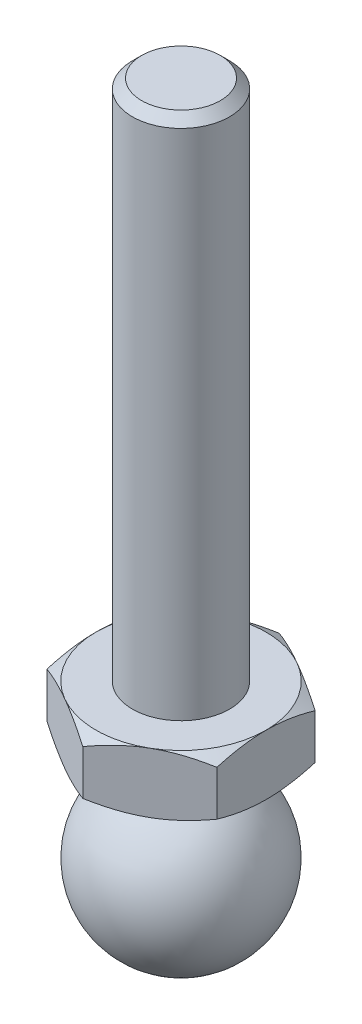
ISO-10303-21;
HEADER;
FILE_DESCRIPTION(('STEP AP214'),'2;1');
FILE_NAME('part.step','',(''),(''),'','','');
FILE_SCHEMA(('AUTOMOTIVE_DESIGN { 1 0 10303 214 1 1 1 1 }'));
ENDSEC;
DATA;
#1=APPLICATION_CONTEXT('core data for automotive mechanical design processes');
#2=APPLICATION_PROTOCOL_DEFINITION('international standard','automotive_design',2000,#1);
#3=PRODUCT_CONTEXT('',#1,'mechanical');
#4=PRODUCT('Part','Part','',(#3));
#5=PRODUCT_RELATED_PRODUCT_CATEGORY('part','',(#4));
#6=PRODUCT_DEFINITION_FORMATION('','',#4);
#7=PRODUCT_DEFINITION_CONTEXT('part definition',#1,'design');
#8=PRODUCT_DEFINITION('design','',#6,#7);
#9=PRODUCT_DEFINITION_SHAPE('','',#8);
#10=(LENGTH_UNIT() NAMED_UNIT(*) SI_UNIT(.MILLI.,.METRE.));
#11=(NAMED_UNIT(*) PLANE_ANGLE_UNIT() SI_UNIT($,.RADIAN.));
#12=(NAMED_UNIT(*) SI_UNIT($,.STERADIAN.) SOLID_ANGLE_UNIT());
#13=UNCERTAINTY_MEASURE_WITH_UNIT(LENGTH_MEASURE(1.E-05),#10,'distance_accuracy_value','');
#14=(GEOMETRIC_REPRESENTATION_CONTEXT(3) GLOBAL_UNCERTAINTY_ASSIGNED_CONTEXT((#13)) GLOBAL_UNIT_ASSIGNED_CONTEXT((#10,
#11,#12)) REPRESENTATION_CONTEXT('',''));
#15=CARTESIAN_POINT('',(0.,0.,0.));
#16=DIRECTION('',(0.,0.,1.));
#17=DIRECTION('',(1.,0.,0.));
#18=AXIS2_PLACEMENT_3D('',#15,#16,#17);
#19=CARTESIAN_POINT('',(0.,12.6,0.));
#20=DIRECTION('',(0.,-1.,0.));
#21=DIRECTION('',(0.,0.,-1.));
#22=AXIS2_PLACEMENT_3D('',#19,#20,#21);
#23=CONICAL_SURFACE('',#22,7.,1.0471975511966);
#24=CARTESIAN_POINT('',(-7.,8.53828268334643,12.1648696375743));
#25=CARTESIAN_POINT('',(-7.,8.68391573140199,11.8738003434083));
#26=CARTESIAN_POINT('',(-7.,8.82854589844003,11.5822239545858));
#27=CARTESIAN_POINT('',(-7.,9.11531569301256,10.997825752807));
#28=CARTESIAN_POINT('',(-7.,9.25745515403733,10.7050038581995));
#29=CARTESIAN_POINT('',(-7.,9.53902214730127,10.117331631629));
#30=CARTESIAN_POINT('',(-7.,9.67844364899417,9.8224784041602));
#31=CARTESIAN_POINT('',(-7.,9.95360604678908,9.23106328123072));
#32=CARTESIAN_POINT('',(-7.,10.0893470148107,8.93450141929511));
#33=CARTESIAN_POINT('',(-7.,10.3623110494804,8.32593520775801));
#34=CARTESIAN_POINT('',(-7.,10.4993254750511,8.0138369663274));
#35=CARTESIAN_POINT('',(-7.,10.7671383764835,7.38695797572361));
#36=CARTESIAN_POINT('',(-7.,10.8979365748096,7.07217710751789));
#37=CARTESIAN_POINT('',(-7.,11.1515530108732,6.43962449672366));
#38=CARTESIAN_POINT('',(-7.,11.274376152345,6.12185473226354));
#39=CARTESIAN_POINT('',(-7.,11.5099016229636,5.4826031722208));
#40=CARTESIAN_POINT('',(-7.,11.6226050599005,5.16112178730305));
#41=CARTESIAN_POINT('',(-7.,11.8599014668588,4.43821731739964));
#42=CARTESIAN_POINT('',(-7.,11.981118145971,4.03566892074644));
#43=CARTESIAN_POINT('',(-7.,12.1969740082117,3.22331060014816));
#44=CARTESIAN_POINT('',(-7.,12.2916155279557,2.81350131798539));
#45=CARTESIAN_POINT('',(-7.,12.4069999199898,2.1974256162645));
#46=CARTESIAN_POINT('',(-7.,12.4408518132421,1.99359214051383));
#47=CARTESIAN_POINT('',(-7.,12.4993191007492,1.58461613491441));
#48=CARTESIAN_POINT('',(-7.,12.5239358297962,1.37947379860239));
#49=CARTESIAN_POINT('',(-7.,12.5631968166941,0.968289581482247));
#50=CARTESIAN_POINT('',(-7.,12.5778439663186,0.762247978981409));
#51=CARTESIAN_POINT('',(-7.,12.5967021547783,0.349683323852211));
#52=CARTESIAN_POINT('',(-7.,12.6009132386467,0.143160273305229));
#53=CARTESIAN_POINT('',(-7.,12.5987493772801,-0.271082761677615));
#54=CARTESIAN_POINT('',(-7.,12.5923100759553,-0.47880240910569));
#55=CARTESIAN_POINT('',(-7.,12.5689433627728,-0.893645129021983));
#56=CARTESIAN_POINT('',(-7.,12.5520159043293,-1.10076819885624));
#57=CARTESIAN_POINT('',(-7.,12.5082124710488,-1.5140304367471));
#58=CARTESIAN_POINT('',(-7.,12.4813327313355,-1.72016920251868));
#59=CARTESIAN_POINT('',(-7.,12.4184180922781,-2.13103319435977));
#60=CARTESIAN_POINT('',(-7.,12.3823828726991,-2.33575837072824));
#61=CARTESIAN_POINT('',(-7.,12.2605686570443,-2.95437912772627));
#62=CARTESIAN_POINT('',(-7.,12.1618729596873,-3.36575077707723));
#63=CARTESIAN_POINT('',(-7.,11.9384533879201,-4.18138012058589));
#64=CARTESIAN_POINT('',(-7.,11.8137148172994,-4.58563365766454));
#65=CARTESIAN_POINT('',(-7.,11.5733248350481,-5.30320893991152));
#66=CARTESIAN_POINT('',(-7.,11.4612875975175,-5.6177595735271));
#67=CARTESIAN_POINT('',(-7.,11.2278514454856,-6.24325021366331));
#68=CARTESIAN_POINT('',(-7.,11.1064551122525,-6.55419118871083));
#69=CARTESIAN_POINT('',(-7.,10.8562070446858,-7.17328528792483));
#70=CARTESIAN_POINT('',(-7.,10.7273503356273,-7.48143638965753));
#71=CARTESIAN_POINT('',(-7.,10.4637823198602,-8.09523802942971));
#72=CARTESIAN_POINT('',(-7.,10.3290706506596,-8.40088841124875));
#73=CARTESIAN_POINT('',(-7.,10.0607840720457,-8.99716345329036));
#74=CARTESIAN_POINT('',(-7.,9.92740317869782,-9.2878756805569));
#75=CARTESIAN_POINT('',(-7.,9.65714715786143,-9.86766295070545));
#76=CARTESIAN_POINT('',(-7.,9.52027208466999,-10.1567380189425));
#77=CARTESIAN_POINT('',(-7.,9.24389786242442,-10.7329937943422));
#78=CARTESIAN_POINT('',(-7.,9.10440383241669,-11.0201769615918));
#79=CARTESIAN_POINT('',(-7.,8.82302286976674,-11.5933594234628));
#80=CARTESIAN_POINT('',(-7.,8.68113600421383,-11.879358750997));
#81=CARTESIAN_POINT('',(-7.,8.53828268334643,-12.1648696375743));
#82=B_SPLINE_CURVE_WITH_KNOTS('',3,(#24,#25,#26,#27,#28,#29,#30,#31,#32,#33,#34,#35,#36,#37,#38,
#39,#40,#41,#42,#43,#44,#45,#46,#47,#48,#49,#50,#51,#52,#53,#54,#55,#56,#57,#58,#59,#60,#61,#62,
#63,#64,#65,#66,#67,#68,#69,#70,#71,#72,#73,#74,#75,#76,#77,#78,#79,#80,#81),.UNSPECIFIED.,.F.,
.F.,(4,2,2,2,2,2,2,2,2,2,2,2,2,2,2,2,2,2,2,2,2,2,2,2,2,2,2,2,4),(0.,0.976413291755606,
1.95289161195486,2.93133423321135,3.90975772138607,4.93225217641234,5.95479223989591,
6.97669748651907,7.99849072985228,9.25906449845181,10.5195273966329,11.1392271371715,
11.7588372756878,12.3782676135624,12.9976952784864,13.6208795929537,14.2440666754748,
14.8674897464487,15.490934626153,16.7587972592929,18.027377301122,19.0289263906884,
20.0302002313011,21.0321496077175,22.0341611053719,22.9936838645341,23.9531917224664,
24.9109871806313,25.8687558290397),.UNSPECIFIED.);
#83=CARTESIAN_POINT('',(-7.,11.9747852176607,4.04145188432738));
#84=VERTEX_POINT('',#83);
#85=CARTESIAN_POINT('',(-7.,12.6,0.));
#86=VERTEX_POINT('',#85);
#87=EDGE_CURVE('E312',#84,#86,#82,.T.);
#88=ORIENTED_EDGE('',*,*,#87,.F.);
#89=CARTESIAN_POINT('',(0.0002,11.9747185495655,8.0830192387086));
#90=CARTESIAN_POINT('',(-0.153667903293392,12.0260001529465,7.99418356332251));
#91=CARTESIAN_POINT('',(-0.30810950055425,12.0749544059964,7.90501666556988));
#92=CARTESIAN_POINT('',(-0.618246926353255,12.1675672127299,7.72595873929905));
#93=CARTESIAN_POINT('',(-0.773943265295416,12.2112234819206,7.63606741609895));
#94=CARTESIAN_POINT('',(-1.24352516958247,12.3333884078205,7.36495417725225));
#95=CARTESIAN_POINT('',(-1.5592643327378,12.402874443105,7.18266208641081));
#96=CARTESIAN_POINT('',(-2.03176224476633,12.4843550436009,6.9098652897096));
#97=CARTESIAN_POINT('',(-2.18710922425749,12.5075665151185,6.82017566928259));
#98=CARTESIAN_POINT('',(-2.49850511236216,12.5464887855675,6.64039116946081));
#99=CARTESIAN_POINT('',(-2.65455395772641,12.5622002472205,6.55029632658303));
#100=CARTESIAN_POINT('',(-2.96692267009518,12.5857220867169,6.36995016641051));
#101=CARTESIAN_POINT('',(-3.12324202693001,12.5935414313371,6.27969914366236));
#102=CARTESIAN_POINT('',(-3.43601650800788,12.6011197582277,6.09911871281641));
#103=CARTESIAN_POINT('',(-3.59247162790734,12.600878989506,6.00878930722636));
#104=CARTESIAN_POINT('',(-4.02110687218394,12.5891402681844,5.76131663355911));
#105=CARTESIAN_POINT('',(-4.2931466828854,12.5694342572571,5.60425437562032));
#106=CARTESIAN_POINT('',(-4.8354194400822,12.5069465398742,5.29117305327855));
#107=CARTESIAN_POINT('',(-5.10565047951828,12.464143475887,5.13515508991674));
#108=CARTESIAN_POINT('',(-5.64901454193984,12.3571483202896,4.82144370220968));
#109=CARTESIAN_POINT('',(-5.92207900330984,12.2925029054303,4.66378986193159));
#110=CARTESIAN_POINT('',(-6.46413578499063,12.145783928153,4.35083323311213));
#111=CARTESIAN_POINT('',(-6.73313504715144,12.0637448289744,4.19552643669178));
#112=CARTESIAN_POINT('',(-7.0002,11.9747185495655,4.04133641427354));
#113=B_SPLINE_CURVE_WITH_KNOTS('',3,(#89,#90,#91,#92,#93,#94,#95,#96,#97,#98,#99,#100,#101,#102,
#103,#104,#105,#106,#107,#108,#109,#110,#111,#112),.UNSPECIFIED.,.F.,.F.,(4,2,2,2,2,2,2,2,2,2,2,
4),(0.,0.554727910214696,1.10969417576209,2.2219327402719,2.76443041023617,3.30688013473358,
3.8487128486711,4.3905288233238,5.33376515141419,6.27787517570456,7.2429241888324,
8.20607866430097),.UNSPECIFIED.);
#114=CARTESIAN_POINT('',(-3.5,12.6,6.06217782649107));
#115=VERTEX_POINT('',#114);
#116=EDGE_CURVE('E138',#115,#84,#113,.T.);
#117=ORIENTED_EDGE('',*,*,#116,.F.);
#118=CARTESIAN_POINT('',(0.,12.6,0.));
#119=DIRECTION('',(0.,-1.,0.));
#120=DIRECTION('',(0.,0.,-1.));
#121=AXIS2_PLACEMENT_3D('',#118,#119,#120);
#122=CIRCLE('',#121,7.);
#123=EDGE_CURVE('E286',#115,#86,#122,.T.);
#124=ORIENTED_EDGE('',*,*,#123,.T.);
#125=EDGE_LOOP('',(#88,#117,#124));
#126=FACE_BOUND('',#125,.T.);
#127=ADVANCED_FACE('F17',(#126),#23,.T.);
#128=CARTESIAN_POINT('',(-7.,11.9747852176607,-4.04145188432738));
#129=VERTEX_POINT('',#128);
#130=EDGE_CURVE('E196',#86,#129,#82,.T.);
#131=ORIENTED_EDGE('',*,*,#130,.F.);
#132=CARTESIAN_POINT('',(-3.5,12.6,-6.06217782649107));
#133=VERTEX_POINT('',#132);
#134=EDGE_CURVE('E198',#86,#133,#122,.T.);
#135=ORIENTED_EDGE('',*,*,#134,.T.);
#136=CARTESIAN_POINT('',(-7.0002,11.9747185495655,-4.04133641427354));
#137=CARTESIAN_POINT('',(-6.84633209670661,12.0260001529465,-4.13017208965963));
#138=CARTESIAN_POINT('',(-6.69189049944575,12.0749544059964,-4.21933898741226));
#139=CARTESIAN_POINT('',(-6.38175307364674,12.1675672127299,-4.39839691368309));
#140=CARTESIAN_POINT('',(-6.22605673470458,12.2112234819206,-4.48828823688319));
#141=CARTESIAN_POINT('',(-5.75647483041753,12.3333884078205,-4.75940147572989));
#142=CARTESIAN_POINT('',(-5.4407356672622,12.402874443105,-4.94169356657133));
#143=CARTESIAN_POINT('',(-4.96823775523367,12.4843550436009,-5.21449036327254));
#144=CARTESIAN_POINT('',(-4.81289077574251,12.5075665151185,-5.30417998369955));
#145=CARTESIAN_POINT('',(-4.50149488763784,12.5464887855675,-5.48396448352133));
#146=CARTESIAN_POINT('',(-4.34544604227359,12.5622002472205,-5.57405932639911));
#147=CARTESIAN_POINT('',(-4.03307732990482,12.5857220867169,-5.75440548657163));
#148=CARTESIAN_POINT('',(-3.87675797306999,12.5935414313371,-5.84465650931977));
#149=CARTESIAN_POINT('',(-3.56398349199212,12.6011197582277,-6.02523694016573));
#150=CARTESIAN_POINT('',(-3.40752837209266,12.600878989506,-6.11556634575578));
#151=CARTESIAN_POINT('',(-2.97889312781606,12.5891402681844,-6.36303901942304));
#152=CARTESIAN_POINT('',(-2.7068533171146,12.5694342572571,-6.52010127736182));
#153=CARTESIAN_POINT('',(-2.1645805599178,12.5069465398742,-6.83318259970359));
#154=CARTESIAN_POINT('',(-1.89434952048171,12.464143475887,-6.9892005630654));
#155=CARTESIAN_POINT('',(-1.35098545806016,12.3571483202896,-7.30291195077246));
#156=CARTESIAN_POINT('',(-1.07792099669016,12.2925029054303,-7.46056579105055));
#157=CARTESIAN_POINT('',(-0.535864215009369,12.145783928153,-7.77352241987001));
#158=CARTESIAN_POINT('',(-0.266864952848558,12.0637448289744,-7.92882921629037));
#159=CARTESIAN_POINT('',(0.000200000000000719,11.9747185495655,-8.0830192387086));
#160=B_SPLINE_CURVE_WITH_KNOTS('',3,(#136,#137,#138,#139,#140,#141,#142,#143,#144,#145,#146,
#147,#148,#149,#150,#151,#152,#153,#154,#155,#156,#157,#158,#159),.UNSPECIFIED.,.F.,.F.,(4,2,2,
2,2,2,2,2,2,2,2,4),(0.,0.554727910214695,1.10969417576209,2.2219327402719,2.76443041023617,
3.30688013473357,3.8487128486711,4.39052882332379,5.33376515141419,6.27787517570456,
7.2429241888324,8.20607866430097),.UNSPECIFIED.);
#161=EDGE_CURVE('E186',#129,#133,#160,.T.);
#162=ORIENTED_EDGE('',*,*,#161,.F.);
#163=EDGE_LOOP('',(#131,#135,#162));
#164=FACE_BOUND('',#163,.T.);
#165=ADVANCED_FACE('F195',(#164),#23,.T.);
#166=CARTESIAN_POINT('',(0.,11.9747852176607,-8.08290376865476));
#167=VERTEX_POINT('',#166);
#168=EDGE_CURVE('E200',#133,#167,#160,.T.);
#169=ORIENTED_EDGE('',*,*,#168,.F.);
#170=CARTESIAN_POINT('',(3.5,12.6,-6.06217782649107));
#171=VERTEX_POINT('',#170);
#172=EDGE_CURVE('E296',#133,#171,#122,.T.);
#173=ORIENTED_EDGE('',*,*,#172,.T.);
#174=CARTESIAN_POINT('',(-0.0002,11.9747185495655,-8.0830192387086));
#175=CARTESIAN_POINT('',(0.153667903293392,12.0260001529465,-7.99418356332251));
#176=CARTESIAN_POINT('',(0.30810950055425,12.0749544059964,-7.90501666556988));
#177=CARTESIAN_POINT('',(0.618246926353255,12.1675672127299,-7.72595873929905));
#178=CARTESIAN_POINT('',(0.773943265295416,12.2112234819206,-7.63606741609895));
#179=CARTESIAN_POINT('',(1.24352516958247,12.3333884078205,-7.36495417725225));
#180=CARTESIAN_POINT('',(1.5592643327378,12.402874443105,-7.18266208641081));
#181=CARTESIAN_POINT('',(2.03176224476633,12.4843550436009,-6.9098652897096));
#182=CARTESIAN_POINT('',(2.18710922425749,12.5075665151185,-6.82017566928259));
#183=CARTESIAN_POINT('',(2.49850511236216,12.5464887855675,-6.64039116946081));
#184=CARTESIAN_POINT('',(2.65455395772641,12.5622002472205,-6.55029632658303));
#185=CARTESIAN_POINT('',(2.96692267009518,12.5857220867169,-6.36995016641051));
#186=CARTESIAN_POINT('',(3.12324202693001,12.5935414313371,-6.27969914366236));
#187=CARTESIAN_POINT('',(3.43601650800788,12.6011197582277,-6.09911871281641));
#188=CARTESIAN_POINT('',(3.59247162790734,12.600878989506,-6.00878930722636));
#189=CARTESIAN_POINT('',(4.02110687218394,12.5891402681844,-5.76131663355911));
#190=CARTESIAN_POINT('',(4.2931466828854,12.5694342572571,-5.60425437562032));
#191=CARTESIAN_POINT('',(4.8354194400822,12.5069465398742,-5.29117305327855));
#192=CARTESIAN_POINT('',(5.10565047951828,12.464143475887,-5.13515508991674));
#193=CARTESIAN_POINT('',(5.64901454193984,12.3571483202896,-4.82144370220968));
#194=CARTESIAN_POINT('',(5.92207900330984,12.2925029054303,-4.66378986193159));
#195=CARTESIAN_POINT('',(6.46413578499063,12.145783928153,-4.35083323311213));
#196=CARTESIAN_POINT('',(6.73313504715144,12.0637448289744,-4.19552643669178));
#197=CARTESIAN_POINT('',(7.0002,11.9747185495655,-4.04133641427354));
#198=B_SPLINE_CURVE_WITH_KNOTS('',3,(#174,#175,#176,#177,#178,#179,#180,#181,#182,#183,#184,
#185,#186,#187,#188,#189,#190,#191,#192,#193,#194,#195,#196,#197),.UNSPECIFIED.,.F.,.F.,(4,2,2,
2,2,2,2,2,2,2,2,4),(0.,0.554727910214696,1.10969417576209,2.2219327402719,2.76443041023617,
3.30688013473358,3.8487128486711,4.3905288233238,5.33376515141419,6.27787517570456,
7.2429241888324,8.20607866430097),.UNSPECIFIED.);
#199=EDGE_CURVE('E246',#167,#171,#198,.T.);
#200=ORIENTED_EDGE('',*,*,#199,.F.);
#201=EDGE_LOOP('',(#169,#173,#200));
#202=FACE_BOUND('',#201,.T.);
#203=ADVANCED_FACE('F345',(#202),#23,.T.);
#204=CARTESIAN_POINT('',(7.,11.9747852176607,-4.04145188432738));
#205=VERTEX_POINT('',#204);
#206=EDGE_CURVE('E241',#171,#205,#198,.T.);
#207=ORIENTED_EDGE('',*,*,#206,.F.);
#208=CARTESIAN_POINT('',(7.,12.6,0.));
#209=VERTEX_POINT('',#208);
#210=EDGE_CURVE('E291',#171,#209,#122,.T.);
#211=ORIENTED_EDGE('',*,*,#210,.T.);
#212=CARTESIAN_POINT('',(7.,8.53828268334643,-12.1648696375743));
#213=CARTESIAN_POINT('',(7.,8.68391573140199,-11.8738003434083));
#214=CARTESIAN_POINT('',(7.,8.82854589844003,-11.5822239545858));
#215=CARTESIAN_POINT('',(7.,9.11531569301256,-10.997825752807));
#216=CARTESIAN_POINT('',(7.,9.25745515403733,-10.7050038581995));
#217=CARTESIAN_POINT('',(7.,9.53902214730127,-10.117331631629));
#218=CARTESIAN_POINT('',(7.,9.67844364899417,-9.8224784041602));
#219=CARTESIAN_POINT('',(7.,9.95360604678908,-9.23106328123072));
#220=CARTESIAN_POINT('',(7.,10.0893470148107,-8.93450141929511));
#221=CARTESIAN_POINT('',(7.,10.3623110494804,-8.32593520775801));
#222=CARTESIAN_POINT('',(7.,10.4993254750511,-8.0138369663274));
#223=CARTESIAN_POINT('',(7.,10.7671383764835,-7.38695797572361));
#224=CARTESIAN_POINT('',(7.,10.8979365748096,-7.07217710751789));
#225=CARTESIAN_POINT('',(7.,11.1515530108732,-6.43962449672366));
#226=CARTESIAN_POINT('',(7.,11.274376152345,-6.12185473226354));
#227=CARTESIAN_POINT('',(7.,11.5099016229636,-5.4826031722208));
#228=CARTESIAN_POINT('',(7.,11.6226050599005,-5.16112178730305));
#229=CARTESIAN_POINT('',(7.,11.8599014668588,-4.43821731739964));
#230=CARTESIAN_POINT('',(7.,11.981118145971,-4.03566892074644));
#231=CARTESIAN_POINT('',(7.,12.1969740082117,-3.22331060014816));
#232=CARTESIAN_POINT('',(7.,12.2916155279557,-2.81350131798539));
#233=CARTESIAN_POINT('',(7.,12.4069999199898,-2.1974256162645));
#234=CARTESIAN_POINT('',(7.,12.4408518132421,-1.99359214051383));
#235=CARTESIAN_POINT('',(7.,12.4993191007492,-1.58461613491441));
#236=CARTESIAN_POINT('',(7.,12.5239358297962,-1.37947379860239));
#237=CARTESIAN_POINT('',(7.,12.5631968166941,-0.968289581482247));
#238=CARTESIAN_POINT('',(7.,12.5778439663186,-0.762247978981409));
#239=CARTESIAN_POINT('',(7.,12.5967021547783,-0.349683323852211));
#240=CARTESIAN_POINT('',(7.,12.6009132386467,-0.143160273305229));
#241=CARTESIAN_POINT('',(7.,12.5987493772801,0.271082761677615));
#242=CARTESIAN_POINT('',(7.,12.5923100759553,0.47880240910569));
#243=CARTESIAN_POINT('',(7.,12.5689433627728,0.893645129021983));
#244=CARTESIAN_POINT('',(7.,12.5520159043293,1.10076819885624));
#245=CARTESIAN_POINT('',(7.,12.5082124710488,1.5140304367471));
#246=CARTESIAN_POINT('',(7.,12.4813327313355,1.72016920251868));
#247=CARTESIAN_POINT('',(7.,12.4184180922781,2.13103319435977));
#248=CARTESIAN_POINT('',(7.,12.3823828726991,2.33575837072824));
#249=CARTESIAN_POINT('',(7.,12.2605686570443,2.95437912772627));
#250=CARTESIAN_POINT('',(7.,12.1618729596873,3.36575077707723));
#251=CARTESIAN_POINT('',(7.,11.9384533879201,4.18138012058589));
#252=CARTESIAN_POINT('',(7.,11.8137148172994,4.58563365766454));
#253=CARTESIAN_POINT('',(7.,11.5733248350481,5.30320893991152));
#254=CARTESIAN_POINT('',(7.,11.4612875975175,5.6177595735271));
#255=CARTESIAN_POINT('',(7.,11.2278514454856,6.24325021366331));
#256=CARTESIAN_POINT('',(7.,11.1064551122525,6.55419118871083));
#257=CARTESIAN_POINT('',(7.,10.8562070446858,7.17328528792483));
#258=CARTESIAN_POINT('',(7.,10.7273503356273,7.48143638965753));
#259=CARTESIAN_POINT('',(7.,10.4637823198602,8.09523802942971));
#260=CARTESIAN_POINT('',(7.,10.3290706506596,8.40088841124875));
#261=CARTESIAN_POINT('',(7.,10.0607840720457,8.99716345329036));
#262=CARTESIAN_POINT('',(7.,9.92740317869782,9.2878756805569));
#263=CARTESIAN_POINT('',(7.,9.65714715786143,9.86766295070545));
#264=CARTESIAN_POINT('',(7.,9.52027208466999,10.1567380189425));
#265=CARTESIAN_POINT('',(7.,9.24389786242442,10.7329937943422));
#266=CARTESIAN_POINT('',(7.,9.10440383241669,11.0201769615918));
#267=CARTESIAN_POINT('',(7.,8.82302286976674,11.5933594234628));
#268=CARTESIAN_POINT('',(7.,8.68113600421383,11.879358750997));
#269=CARTESIAN_POINT('',(7.,8.53828268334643,12.1648696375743));
#270=B_SPLINE_CURVE_WITH_KNOTS('',3,(#212,#213,#214,#215,#216,#217,#218,#219,#220,#221,#222,
#223,#224,#225,#226,#227,#228,#229,#230,#231,#232,#233,#234,#235,#236,#237,#238,#239,#240,#241,
#242,#243,#244,#245,#246,#247,#248,#249,#250,#251,#252,#253,#254,#255,#256,#257,#258,#259,#260,
#261,#262,#263,#264,#265,#266,#267,#268,#269),.UNSPECIFIED.,.F.,.F.,(4,2,2,2,2,2,2,2,2,2,2,2,2,
2,2,2,2,2,2,2,2,2,2,2,2,2,2,2,4),(0.,0.976413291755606,1.95289161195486,2.93133423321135,
3.90975772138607,4.93225217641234,5.95479223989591,6.97669748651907,7.99849072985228,
9.25906449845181,10.5195273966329,11.1392271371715,11.7588372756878,12.3782676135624,
12.9976952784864,13.6208795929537,14.2440666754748,14.8674897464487,15.490934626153,
16.7587972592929,18.027377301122,19.0289263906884,20.0302002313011,21.0321496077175,
22.0341611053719,22.9936838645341,23.9531917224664,24.9109871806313,25.8687558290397),.UNSPECIFIED.);
#271=EDGE_CURVE('E252',#205,#209,#270,.T.);
#272=ORIENTED_EDGE('',*,*,#271,.F.);
#273=EDGE_LOOP('',(#207,#211,#272));
#274=FACE_BOUND('',#273,.T.);
#275=ADVANCED_FACE('F355',(#274),#23,.T.);
#276=CARTESIAN_POINT('',(7.,11.9747852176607,4.04145188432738));
#277=VERTEX_POINT('',#276);
#278=EDGE_CURVE('E254',#209,#277,#270,.T.);
#279=ORIENTED_EDGE('',*,*,#278,.F.);
#280=CARTESIAN_POINT('',(3.5,12.6,6.06217782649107));
#281=VERTEX_POINT('',#280);
#282=EDGE_CURVE('E284',#209,#281,#122,.T.);
#283=ORIENTED_EDGE('',*,*,#282,.T.);
#284=CARTESIAN_POINT('',(7.0002,11.9747185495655,4.04133641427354));
#285=CARTESIAN_POINT('',(6.84633209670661,12.0260001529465,4.13017208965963));
#286=CARTESIAN_POINT('',(6.69189049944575,12.0749544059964,4.21933898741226));
#287=CARTESIAN_POINT('',(6.38175307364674,12.1675672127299,4.39839691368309));
#288=CARTESIAN_POINT('',(6.22605673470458,12.2112234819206,4.48828823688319));
#289=CARTESIAN_POINT('',(5.75647483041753,12.3333884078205,4.75940147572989));
#290=CARTESIAN_POINT('',(5.4407356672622,12.402874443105,4.94169356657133));
#291=CARTESIAN_POINT('',(4.96823775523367,12.4843550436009,5.21449036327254));
#292=CARTESIAN_POINT('',(4.81289077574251,12.5075665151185,5.30417998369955));
#293=CARTESIAN_POINT('',(4.50149488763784,12.5464887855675,5.48396448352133));
#294=CARTESIAN_POINT('',(4.34544604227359,12.5622002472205,5.57405932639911));
#295=CARTESIAN_POINT('',(4.03307732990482,12.5857220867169,5.75440548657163));
#296=CARTESIAN_POINT('',(3.87675797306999,12.5935414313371,5.84465650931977));
#297=CARTESIAN_POINT('',(3.56398349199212,12.6011197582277,6.02523694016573));
#298=CARTESIAN_POINT('',(3.40752837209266,12.600878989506,6.11556634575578));
#299=CARTESIAN_POINT('',(2.97889312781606,12.5891402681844,6.36303901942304));
#300=CARTESIAN_POINT('',(2.7068533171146,12.5694342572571,6.52010127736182));
#301=CARTESIAN_POINT('',(2.1645805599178,12.5069465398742,6.83318259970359));
#302=CARTESIAN_POINT('',(1.89434952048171,12.464143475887,6.9892005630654));
#303=CARTESIAN_POINT('',(1.35098545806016,12.3571483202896,7.30291195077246));
#304=CARTESIAN_POINT('',(1.07792099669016,12.2925029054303,7.46056579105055));
#305=CARTESIAN_POINT('',(0.535864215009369,12.145783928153,7.77352241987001));
#306=CARTESIAN_POINT('',(0.266864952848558,12.0637448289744,7.92882921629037));
#307=CARTESIAN_POINT('',(-0.000200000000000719,11.9747185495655,8.0830192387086));
#308=B_SPLINE_CURVE_WITH_KNOTS('',3,(#284,#285,#286,#287,#288,#289,#290,#291,#292,#293,#294,
#295,#296,#297,#298,#299,#300,#301,#302,#303,#304,#305,#306,#307),.UNSPECIFIED.,.F.,.F.,(4,2,2,
2,2,2,2,2,2,2,2,4),(0.,0.554727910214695,1.10969417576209,2.2219327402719,2.76443041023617,
3.30688013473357,3.8487128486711,4.39052882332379,5.33376515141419,6.27787517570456,
7.2429241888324,8.20607866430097),.UNSPECIFIED.);
#309=EDGE_CURVE('E129',#277,#281,#308,.T.);
#310=ORIENTED_EDGE('',*,*,#309,.F.);
#311=EDGE_LOOP('',(#279,#283,#310));
#312=FACE_BOUND('',#311,.T.);
#313=ADVANCED_FACE('F288',(#312),#23,.T.);
#314=CARTESIAN_POINT('',(0.,11.9747852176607,8.08290376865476));
#315=VERTEX_POINT('',#314);
#316=EDGE_CURVE('E119',#281,#315,#308,.T.);
#317=ORIENTED_EDGE('',*,*,#316,.F.);
#318=EDGE_CURVE('E277',#281,#115,#122,.T.);
#319=ORIENTED_EDGE('',*,*,#318,.T.);
#320=EDGE_CURVE('E32',#315,#115,#113,.T.);
#321=ORIENTED_EDGE('',*,*,#320,.F.);
#322=EDGE_LOOP('',(#317,#319,#321));
#323=FACE_BOUND('',#322,.T.);
#324=ADVANCED_FACE('F276',(#323),#23,.T.);
#325=CARTESIAN_POINT('',(0.,55.6,0.));
#326=DIRECTION('',(0.,-1.,0.));
#327=DIRECTION('',(0.,0.,-1.));
#328=AXIS2_PLACEMENT_3D('',#325,#326,#327);
#329=PLANE('',#328);
#330=CARTESIAN_POINT('',(0.,55.6,0.));
#331=DIRECTION('',(0.,-1.,0.));
#332=DIRECTION('',(0.,0.,-1.));
#333=AXIS2_PLACEMENT_3D('',#330,#331,#332);
#334=CIRCLE('',#333,3.233);
#335=CARTESIAN_POINT('',(0.,55.6,-3.233));
#336=VERTEX_POINT('',#335);
#337=EDGE_CURVE('E25',#336,#336,#334,.T.);
#338=ORIENTED_EDGE('',*,*,#337,.F.);
#339=EDGE_LOOP('',(#338));
#340=FACE_BOUND('',#339,.T.);
#341=ADVANCED_FACE('F19',(#340),#329,.F.);
#342=CARTESIAN_POINT('',(0.,55.6,0.));
#343=DIRECTION('',(0.,-1.,0.));
#344=DIRECTION('',(0.,0.,-1.));
#345=AXIS2_PLACEMENT_3D('',#342,#343,#344);
#346=CONICAL_SURFACE('',#345,3.233,0.785398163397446);
#347=CARTESIAN_POINT('',(0.,54.833,0.));
#348=DIRECTION('',(0.,-1.,0.));
#349=DIRECTION('',(0.,0.,-1.));
#350=AXIS2_PLACEMENT_3D('',#347,#348,#349);
#351=CIRCLE('',#350,4.);
#352=CARTESIAN_POINT('',(0.,54.833,-4.));
#353=VERTEX_POINT('',#352);
#354=EDGE_CURVE('E293',#353,#353,#351,.T.);
#355=ORIENTED_EDGE('',*,*,#354,.F.);
#356=EDGE_LOOP('',(#355));
#357=FACE_BOUND('',#356,.T.);
#358=ORIENTED_EDGE('',*,*,#337,.T.);
#359=EDGE_LOOP('',(#358));
#360=FACE_BOUND('',#359,.T.);
#361=ADVANCED_FACE('F353',(#357,#360),#346,.T.);
#362=CARTESIAN_POINT('',(0.,-7.,0.));
#363=DIRECTION('',(0.,-1.,0.));
#364=DIRECTION('',(0.,0.,-1.));
#365=AXIS2_PLACEMENT_3D('',#362,#363,#364);
#366=CYLINDRICAL_SURFACE('',#365,4.);
#367=CARTESIAN_POINT('',(0.,12.6,0.));
#368=DIRECTION('',(0.,-1.,0.));
#369=DIRECTION('',(0.,0.,-1.));
#370=AXIS2_PLACEMENT_3D('',#367,#368,#369);
#371=CIRCLE('',#370,4.);
#372=CARTESIAN_POINT('',(0.,12.6,-4.));
#373=VERTEX_POINT('',#372);
#374=EDGE_CURVE('E290',#373,#373,#371,.T.);
#375=ORIENTED_EDGE('',*,*,#374,.F.);
#376=EDGE_LOOP('',(#375));
#377=FACE_BOUND('',#376,.T.);
#378=ORIENTED_EDGE('',*,*,#354,.T.);
#379=EDGE_LOOP('',(#378));
#380=FACE_BOUND('',#379,.T.);
#381=ADVANCED_FACE('F430',(#377,#380),#366,.T.);
#382=CARTESIAN_POINT('',(4.,12.6,0.));
#383=DIRECTION('',(0.,-1.,0.));
#384=DIRECTION('',(0.,0.,-1.));
#385=AXIS2_PLACEMENT_3D('',#382,#383,#384);
#386=PLANE('',#385);
#387=ORIENTED_EDGE('',*,*,#282,.F.);
#388=ORIENTED_EDGE('',*,*,#210,.F.);
#389=ORIENTED_EDGE('',*,*,#172,.F.);
#390=ORIENTED_EDGE('',*,*,#134,.F.);
#391=ORIENTED_EDGE('',*,*,#123,.F.);
#392=ORIENTED_EDGE('',*,*,#318,.F.);
#393=EDGE_LOOP('',(#387,#388,#389,#390,#391,#392));
#394=FACE_BOUND('',#393,.T.);
#395=ORIENTED_EDGE('',*,*,#374,.T.);
#396=EDGE_LOOP('',(#395));
#397=FACE_BOUND('',#396,.T.);
#398=ADVANCED_FACE('F281',(#394,#397),#386,.F.);
#399=CARTESIAN_POINT('',(-7.,7.65,-4.04145188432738));
#400=DIRECTION('',(-1.,0.,0.));
#401=DIRECTION('',(0.,0.,1.));
#402=AXIS2_PLACEMENT_3D('',#399,#400,#401);
#403=PLANE('',#402);
#404=ORIENTED_EDGE('',*,*,#87,.T.);
#405=ORIENTED_EDGE('',*,*,#130,.T.);
#406=DIRECTION('',(0.,1.,0.));
#407=VECTOR('',#406,1.);
#408=CARTESIAN_POINT('',(-7.,7.65,-4.04145188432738));
#409=LINE('',#408,#407);
#410=CARTESIAN_POINT('',(-7.,8.27521478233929,-4.04145188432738));
#411=VERTEX_POINT('',#410);
#412=EDGE_CURVE('E112',#411,#129,#409,.T.);
#413=ORIENTED_EDGE('',*,*,#412,.F.);
#414=CARTESIAN_POINT('',(-7.,11.7117173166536,-12.1648696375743));
#415=CARTESIAN_POINT('',(-7.,11.566084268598,-11.8738003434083));
#416=CARTESIAN_POINT('',(-7.,11.42145410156,-11.5822239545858));
#417=CARTESIAN_POINT('',(-7.,11.1346843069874,-10.997825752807));
#418=CARTESIAN_POINT('',(-7.,10.9925448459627,-10.7050038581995));
#419=CARTESIAN_POINT('',(-7.,10.7109778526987,-10.1173316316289));
#420=CARTESIAN_POINT('',(-7.,10.5715563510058,-9.82247840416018));
#421=CARTESIAN_POINT('',(-7.,10.2963939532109,-9.2310632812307));
#422=CARTESIAN_POINT('',(-7.,10.1606529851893,-8.93450141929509));
#423=CARTESIAN_POINT('',(-7.,9.88768895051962,-8.32593520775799));
#424=CARTESIAN_POINT('',(-7.,9.75067452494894,-8.01383696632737));
#425=CARTESIAN_POINT('',(-7.,9.48286162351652,-7.38695797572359));
#426=CARTESIAN_POINT('',(-7.,9.3520634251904,-7.07217710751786));
#427=CARTESIAN_POINT('',(-7.,9.09844698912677,-6.43962449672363));
#428=CARTESIAN_POINT('',(-7.,8.97562384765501,-6.12185473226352));
#429=CARTESIAN_POINT('',(-7.,8.7400983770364,-5.48260317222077));
#430=CARTESIAN_POINT('',(-7.,8.62739494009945,-5.16112178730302));
#431=CARTESIAN_POINT('',(-7.,8.39009853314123,-4.43821731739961));
#432=CARTESIAN_POINT('',(-7.,8.26888185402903,-4.0356689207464));
#433=CARTESIAN_POINT('',(-7.,8.05302599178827,-3.22331060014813));
#434=CARTESIAN_POINT('',(-7.,7.95838447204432,-2.81350131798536));
#435=CARTESIAN_POINT('',(-7.,7.84300008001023,-2.19742561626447));
#436=CARTESIAN_POINT('',(-7.,7.80914818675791,-1.9935921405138));
#437=CARTESIAN_POINT('',(-7.,7.75068089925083,-1.58461613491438));
#438=CARTESIAN_POINT('',(-7.,7.7260641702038,-1.37947379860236));
#439=CARTESIAN_POINT('',(-7.,7.68680318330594,-0.968289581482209));
#440=CARTESIAN_POINT('',(-7.,7.67215603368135,-0.762247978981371));
#441=CARTESIAN_POINT('',(-7.,7.65329784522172,-0.349683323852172));
#442=CARTESIAN_POINT('',(-7.,7.64908676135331,-0.14316027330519));
#443=CARTESIAN_POINT('',(-7.,7.65125062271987,0.271082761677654));
#444=CARTESIAN_POINT('',(-7.,7.65768992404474,0.478802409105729));
#445=CARTESIAN_POINT('',(-7.,7.68105663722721,0.893645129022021));
#446=CARTESIAN_POINT('',(-7.,7.69798409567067,1.10076819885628));
#447=CARTESIAN_POINT('',(-7.,7.74178752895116,1.51403043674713));
#448=CARTESIAN_POINT('',(-7.,7.76866726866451,1.72016920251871));
#449=CARTESIAN_POINT('',(-7.,7.83158190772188,2.13103319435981));
#450=CARTESIAN_POINT('',(-7.,7.86761712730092,2.33575837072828));
#451=CARTESIAN_POINT('',(-7.,7.98943134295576,2.95437912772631));
#452=CARTESIAN_POINT('',(-7.,8.08812704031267,3.36575077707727));
#453=CARTESIAN_POINT('',(-7.,8.31154661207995,4.18138012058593));
#454=CARTESIAN_POINT('',(-7.,8.43628518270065,4.58563365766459));
#455=CARTESIAN_POINT('',(-7.,8.67667516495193,5.30320893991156));
#456=CARTESIAN_POINT('',(-7.,8.78871240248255,5.61775957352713));
#457=CARTESIAN_POINT('',(-7.,9.02214855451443,6.24325021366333));
#458=CARTESIAN_POINT('',(-7.,9.14354488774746,6.55419118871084));
#459=CARTESIAN_POINT('',(-7.,9.39379295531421,7.17328528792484));
#460=CARTESIAN_POINT('',(-7.,9.52264966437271,7.48143638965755));
#461=CARTESIAN_POINT('',(-7.,9.78621768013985,8.09523802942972));
#462=CARTESIAN_POINT('',(-7.,9.92092934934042,8.40088841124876));
#463=CARTESIAN_POINT('',(-7.,10.1892159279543,8.99716345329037));
#464=CARTESIAN_POINT('',(-7.,10.3225968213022,9.28787568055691));
#465=CARTESIAN_POINT('',(-7.,10.5928528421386,9.86766295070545));
#466=CARTESIAN_POINT('',(-7.,10.72972791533,10.1567380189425));
#467=CARTESIAN_POINT('',(-7.,11.0061021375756,10.7329937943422));
#468=CARTESIAN_POINT('',(-7.,11.1455961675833,11.0201769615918));
#469=CARTESIAN_POINT('',(-7.,11.4269771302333,11.5933594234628));
#470=CARTESIAN_POINT('',(-7.,11.5688639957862,11.879358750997));
#471=CARTESIAN_POINT('',(-7.,11.7117173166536,12.1648696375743));
#472=B_SPLINE_CURVE_WITH_KNOTS('',3,(#414,#415,#416,#417,#418,#419,#420,#421,#422,#423,#424,
#425,#426,#427,#428,#429,#430,#431,#432,#433,#434,#435,#436,#437,#438,#439,#440,#441,#442,#443,
#444,#445,#446,#447,#448,#449,#450,#451,#452,#453,#454,#455,#456,#457,#458,#459,#460,#461,#462,
#463,#464,#465,#466,#467,#468,#469,#470,#471),.UNSPECIFIED.,.F.,.F.,(4,2,2,2,2,2,2,2,2,2,2,2,2,
2,2,2,2,2,2,2,2,2,2,2,2,2,2,2,4),(0.,0.976413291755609,1.95289161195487,2.93133423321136,
3.90975772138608,4.93225217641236,5.95479223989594,6.9766974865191,7.99849072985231,
9.25906449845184,10.5195273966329,11.1392271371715,11.7588372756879,12.3782676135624,
12.9976952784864,13.6208795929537,14.2440666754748,14.8674897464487,15.490934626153,
16.758797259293,18.027377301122,19.0289263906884,20.0302002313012,21.0321496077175,
22.0341611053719,22.9936838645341,23.9531917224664,24.9109871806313,25.8687558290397),.UNSPECIFIED.);
#473=CARTESIAN_POINT('',(-7.,7.65,0.));
#474=VERTEX_POINT('',#473);
#475=EDGE_CURVE('E202',#411,#474,#472,.T.);
#476=ORIENTED_EDGE('',*,*,#475,.T.);
#477=CARTESIAN_POINT('',(-7.,8.27521478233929,4.04145188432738));
#478=VERTEX_POINT('',#477);
#479=EDGE_CURVE('E199',#474,#478,#472,.T.);
#480=ORIENTED_EDGE('',*,*,#479,.T.);
#481=DIRECTION('',(0.,1.,0.));
#482=VECTOR('',#481,1.);
#483=CARTESIAN_POINT('',(-7.,7.65,4.04145188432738));
#484=LINE('',#483,#482);
#485=EDGE_CURVE('E121',#478,#84,#484,.T.);
#486=ORIENTED_EDGE('',*,*,#485,.T.);
#487=EDGE_LOOP('',(#404,#405,#413,#476,#480,#486));
#488=FACE_BOUND('',#487,.T.);
#489=ADVANCED_FACE('F227',(#488),#403,.T.);
#490=CARTESIAN_POINT('',(0.,7.65,-8.08290376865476));
#491=DIRECTION('',(-0.5,0.,-0.866025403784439));
#492=DIRECTION('',(-0.866025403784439,0.,0.5));
#493=AXIS2_PLACEMENT_3D('',#490,#491,#492);
#494=PLANE('',#493);
#495=ORIENTED_EDGE('',*,*,#161,.T.);
#496=ORIENTED_EDGE('',*,*,#168,.T.);
#497=DIRECTION('',(0.,1.,0.));
#498=VECTOR('',#497,1.);
#499=CARTESIAN_POINT('',(0.,7.65,-8.08290376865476));
#500=LINE('',#499,#498);
#501=CARTESIAN_POINT('',(0.,8.27521478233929,-8.08290376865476));
#502=VERTEX_POINT('',#501);
#503=EDGE_CURVE('E178',#502,#167,#500,.T.);
#504=ORIENTED_EDGE('',*,*,#503,.F.);
#505=CARTESIAN_POINT('',(0.0002,8.2752814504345,-8.0830192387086));
#506=CARTESIAN_POINT('',(-0.153667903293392,8.22399984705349,-7.99418356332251));
#507=CARTESIAN_POINT('',(-0.30810950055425,8.17504559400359,-7.90501666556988));
#508=CARTESIAN_POINT('',(-0.618246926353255,8.08243278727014,-7.72595873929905));
#509=CARTESIAN_POINT('',(-0.773943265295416,8.03877651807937,-7.63606741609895));
#510=CARTESIAN_POINT('',(-1.24352516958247,7.9166115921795,-7.36495417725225));
#511=CARTESIAN_POINT('',(-1.5592643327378,7.84712555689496,-7.18266208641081));
#512=CARTESIAN_POINT('',(-2.03176224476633,7.7656449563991,-6.9098652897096));
#513=CARTESIAN_POINT('',(-2.18710922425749,7.74243348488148,-6.82017566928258));
#514=CARTESIAN_POINT('',(-2.49850511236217,7.70351121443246,-6.64039116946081));
#515=CARTESIAN_POINT('',(-2.65455395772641,7.68779975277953,-6.55029632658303));
#516=CARTESIAN_POINT('',(-2.96692267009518,7.66427791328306,-6.36995016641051));
#517=CARTESIAN_POINT('',(-3.12324202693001,7.65645856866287,-6.27969914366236));
#518=CARTESIAN_POINT('',(-3.43601650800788,7.64888024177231,-6.09911871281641));
#519=CARTESIAN_POINT('',(-3.59247162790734,7.64912101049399,-6.00878930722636));
#520=CARTESIAN_POINT('',(-4.02110687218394,7.6608597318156,-5.76131663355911));
#521=CARTESIAN_POINT('',(-4.2931466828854,7.68056574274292,-5.60425437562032));
#522=CARTESIAN_POINT('',(-4.8354194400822,7.74305346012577,-5.29117305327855));
#523=CARTESIAN_POINT('',(-5.10565047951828,7.78585652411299,-5.13515508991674));
#524=CARTESIAN_POINT('',(-5.64901454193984,7.89285167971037,-4.82144370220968));
#525=CARTESIAN_POINT('',(-5.92207900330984,7.95749709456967,-4.66378986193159));
#526=CARTESIAN_POINT('',(-6.46413578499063,8.10421607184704,-4.35083323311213));
#527=CARTESIAN_POINT('',(-6.73313504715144,8.18625517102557,-4.19552643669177));
#528=CARTESIAN_POINT('',(-7.0002,8.2752814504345,-4.04133641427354));
#529=B_SPLINE_CURVE_WITH_KNOTS('',3,(#505,#506,#507,#508,#509,#510,#511,#512,#513,#514,#515,
#516,#517,#518,#519,#520,#521,#522,#523,#524,#525,#526,#527,#528),.UNSPECIFIED.,.F.,.F.,(4,2,2,
2,2,2,2,2,2,2,2,4),(0.,0.554727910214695,1.10969417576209,2.2219327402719,2.76443041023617,
3.30688013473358,3.8487128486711,4.39052882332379,5.33376515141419,6.27787517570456,
7.2429241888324,8.20607866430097),.UNSPECIFIED.);
#530=CARTESIAN_POINT('',(-3.5,7.65,-6.06217782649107));
#531=VERTEX_POINT('',#530);
#532=EDGE_CURVE('E204',#502,#531,#529,.T.);
#533=ORIENTED_EDGE('',*,*,#532,.T.);
#534=EDGE_CURVE('E189',#531,#411,#529,.T.);
#535=ORIENTED_EDGE('',*,*,#534,.T.);
#536=ORIENTED_EDGE('',*,*,#412,.T.);
#537=EDGE_LOOP('',(#495,#496,#504,#533,#535,#536));
#538=FACE_BOUND('',#537,.T.);
#539=ADVANCED_FACE('F185',(#538),#494,.T.);
#540=CARTESIAN_POINT('',(7.,7.65,-4.04145188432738));
#541=DIRECTION('',(0.5,0.,-0.866025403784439));
#542=DIRECTION('',(-0.866025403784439,0.,-0.5));
#543=AXIS2_PLACEMENT_3D('',#540,#541,#542);
#544=PLANE('',#543);
#545=ORIENTED_EDGE('',*,*,#199,.T.);
#546=ORIENTED_EDGE('',*,*,#206,.T.);
#547=DIRECTION('',(0.,1.,0.));
#548=VECTOR('',#547,1.);
#549=CARTESIAN_POINT('',(7.,7.65,-4.04145188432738));
#550=LINE('',#549,#548);
#551=CARTESIAN_POINT('',(7.,8.27521478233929,-4.04145188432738));
#552=VERTEX_POINT('',#551);
#553=EDGE_CURVE('E175',#552,#205,#550,.T.);
#554=ORIENTED_EDGE('',*,*,#553,.F.);
#555=CARTESIAN_POINT('',(7.0002,8.2752814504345,-4.04133641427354));
#556=CARTESIAN_POINT('',(6.84633209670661,8.22399984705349,-4.13017208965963));
#557=CARTESIAN_POINT('',(6.69189049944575,8.17504559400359,-4.21933898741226));
#558=CARTESIAN_POINT('',(6.38175307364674,8.08243278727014,-4.39839691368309));
#559=CARTESIAN_POINT('',(6.22605673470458,8.03877651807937,-4.48828823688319));
#560=CARTESIAN_POINT('',(5.75647483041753,7.9166115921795,-4.75940147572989));
#561=CARTESIAN_POINT('',(5.4407356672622,7.84712555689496,-4.94169356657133));
#562=CARTESIAN_POINT('',(4.96823775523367,7.7656449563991,-5.21449036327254));
#563=CARTESIAN_POINT('',(4.81289077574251,7.74243348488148,-5.30417998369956));
#564=CARTESIAN_POINT('',(4.50149488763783,7.70351121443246,-5.48396448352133));
#565=CARTESIAN_POINT('',(4.34544604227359,7.68779975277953,-5.57405932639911));
#566=CARTESIAN_POINT('',(4.03307732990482,7.66427791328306,-5.75440548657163));
#567=CARTESIAN_POINT('',(3.87675797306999,7.65645856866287,-5.84465650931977));
#568=CARTESIAN_POINT('',(3.56398349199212,7.64888024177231,-6.02523694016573));
#569=CARTESIAN_POINT('',(3.40752837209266,7.64912101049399,-6.11556634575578));
#570=CARTESIAN_POINT('',(2.97889312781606,7.6608597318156,-6.36303901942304));
#571=CARTESIAN_POINT('',(2.7068533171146,7.68056574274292,-6.52010127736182));
#572=CARTESIAN_POINT('',(2.1645805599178,7.74305346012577,-6.83318259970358));
#573=CARTESIAN_POINT('',(1.89434952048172,7.78585652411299,-6.9892005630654));
#574=CARTESIAN_POINT('',(1.35098545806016,7.89285167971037,-7.30291195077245));
#575=CARTESIAN_POINT('',(1.07792099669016,7.95749709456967,-7.46056579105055));
#576=CARTESIAN_POINT('',(0.53586421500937,8.10421607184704,-7.77352241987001));
#577=CARTESIAN_POINT('',(0.266864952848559,8.18625517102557,-7.92882921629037));
#578=CARTESIAN_POINT('',(-0.000199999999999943,8.2752814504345,-8.0830192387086));
#579=B_SPLINE_CURVE_WITH_KNOTS('',3,(#555,#556,#557,#558,#559,#560,#561,#562,#563,#564,#565,
#566,#567,#568,#569,#570,#571,#572,#573,#574,#575,#576,#577,#578),.UNSPECIFIED.,.F.,.F.,(4,2,2,
2,2,2,2,2,2,2,2,4),(0.,0.554727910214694,1.10969417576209,2.2219327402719,2.76443041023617,
3.30688013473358,3.8487128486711,4.39052882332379,5.33376515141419,6.27787517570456,
7.2429241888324,8.20607866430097),.UNSPECIFIED.);
#580=CARTESIAN_POINT('',(3.5,7.65,-6.06217782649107));
#581=VERTEX_POINT('',#580);
#582=EDGE_CURVE('E247',#552,#581,#579,.T.);
#583=ORIENTED_EDGE('',*,*,#582,.T.);
#584=EDGE_CURVE('E235',#581,#502,#579,.T.);
#585=ORIENTED_EDGE('',*,*,#584,.T.);
#586=ORIENTED_EDGE('',*,*,#503,.T.);
#587=EDGE_LOOP('',(#545,#546,#554,#583,#585,#586));
#588=FACE_BOUND('',#587,.T.);
#589=ADVANCED_FACE('F226',(#588),#544,.T.);
#590=CARTESIAN_POINT('',(7.,7.65,4.04145188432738));
#591=DIRECTION('',(1.,0.,0.));
#592=DIRECTION('',(0.,0.,-1.));
#593=AXIS2_PLACEMENT_3D('',#590,#591,#592);
#594=PLANE('',#593);
#595=ORIENTED_EDGE('',*,*,#271,.T.);
#596=ORIENTED_EDGE('',*,*,#278,.T.);
#597=DIRECTION('',(0.,1.,0.));
#598=VECTOR('',#597,1.);
#599=CARTESIAN_POINT('',(7.,7.65,4.04145188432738));
#600=LINE('',#599,#598);
#601=CARTESIAN_POINT('',(7.,8.27521478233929,4.04145188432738));
#602=VERTEX_POINT('',#601);
#603=EDGE_CURVE('E120',#602,#277,#600,.T.);
#604=ORIENTED_EDGE('',*,*,#603,.F.);
#605=CARTESIAN_POINT('',(7.,11.7117173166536,12.1648696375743));
#606=CARTESIAN_POINT('',(7.,11.566084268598,11.8738003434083));
#607=CARTESIAN_POINT('',(7.,11.42145410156,11.5822239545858));
#608=CARTESIAN_POINT('',(7.,11.1346843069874,10.997825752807));
#609=CARTESIAN_POINT('',(7.,10.9925448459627,10.7050038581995));
#610=CARTESIAN_POINT('',(7.,10.7109778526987,10.1173316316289));
#611=CARTESIAN_POINT('',(7.,10.5715563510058,9.82247840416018));
#612=CARTESIAN_POINT('',(7.,10.2963939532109,9.2310632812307));
#613=CARTESIAN_POINT('',(7.,10.1606529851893,8.93450141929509));
#614=CARTESIAN_POINT('',(7.,9.88768895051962,8.32593520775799));
#615=CARTESIAN_POINT('',(7.,9.75067452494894,8.01383696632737));
#616=CARTESIAN_POINT('',(7.,9.48286162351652,7.38695797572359));
#617=CARTESIAN_POINT('',(7.,9.3520634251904,7.07217710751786));
#618=CARTESIAN_POINT('',(7.,9.09844698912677,6.43962449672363));
#619=CARTESIAN_POINT('',(7.,8.97562384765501,6.12185473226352));
#620=CARTESIAN_POINT('',(7.,8.7400983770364,5.48260317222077));
#621=CARTESIAN_POINT('',(7.,8.62739494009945,5.16112178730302));
#622=CARTESIAN_POINT('',(7.,8.39009853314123,4.43821731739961));
#623=CARTESIAN_POINT('',(7.,8.26888185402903,4.0356689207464));
#624=CARTESIAN_POINT('',(7.,8.05302599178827,3.22331060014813));
#625=CARTESIAN_POINT('',(7.,7.95838447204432,2.81350131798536));
#626=CARTESIAN_POINT('',(7.,7.84300008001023,2.19742561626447));
#627=CARTESIAN_POINT('',(7.,7.80914818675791,1.9935921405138));
#628=CARTESIAN_POINT('',(7.,7.75068089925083,1.58461613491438));
#629=CARTESIAN_POINT('',(7.,7.7260641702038,1.37947379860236));
#630=CARTESIAN_POINT('',(7.,7.68680318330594,0.968289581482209));
#631=CARTESIAN_POINT('',(7.,7.67215603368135,0.762247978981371));
#632=CARTESIAN_POINT('',(7.,7.65329784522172,0.349683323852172));
#633=CARTESIAN_POINT('',(7.,7.64908676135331,0.14316027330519));
#634=CARTESIAN_POINT('',(7.,7.65125062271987,-0.271082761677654));
#635=CARTESIAN_POINT('',(7.,7.65768992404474,-0.478802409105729));
#636=CARTESIAN_POINT('',(7.,7.68105663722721,-0.893645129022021));
#637=CARTESIAN_POINT('',(7.,7.69798409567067,-1.10076819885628));
#638=CARTESIAN_POINT('',(7.,7.74178752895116,-1.51403043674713));
#639=CARTESIAN_POINT('',(7.,7.76866726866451,-1.72016920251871));
#640=CARTESIAN_POINT('',(7.,7.83158190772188,-2.13103319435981));
#641=CARTESIAN_POINT('',(7.,7.86761712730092,-2.33575837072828));
#642=CARTESIAN_POINT('',(7.,7.98943134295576,-2.95437912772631));
#643=CARTESIAN_POINT('',(7.,8.08812704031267,-3.36575077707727));
#644=CARTESIAN_POINT('',(7.,8.31154661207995,-4.18138012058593));
#645=CARTESIAN_POINT('',(7.,8.43628518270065,-4.58563365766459));
#646=CARTESIAN_POINT('',(7.,8.67667516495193,-5.30320893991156));
#647=CARTESIAN_POINT('',(7.,8.78871240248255,-5.61775957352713));
#648=CARTESIAN_POINT('',(7.,9.02214855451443,-6.24325021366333));
#649=CARTESIAN_POINT('',(7.,9.14354488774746,-6.55419118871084));
#650=CARTESIAN_POINT('',(7.,9.39379295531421,-7.17328528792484));
#651=CARTESIAN_POINT('',(7.,9.52264966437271,-7.48143638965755));
#652=CARTESIAN_POINT('',(7.,9.78621768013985,-8.09523802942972));
#653=CARTESIAN_POINT('',(7.,9.92092934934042,-8.40088841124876));
#654=CARTESIAN_POINT('',(7.,10.1892159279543,-8.99716345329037));
#655=CARTESIAN_POINT('',(7.,10.3225968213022,-9.28787568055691));
#656=CARTESIAN_POINT('',(7.,10.5928528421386,-9.86766295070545));
#657=CARTESIAN_POINT('',(7.,10.72972791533,-10.1567380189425));
#658=CARTESIAN_POINT('',(7.,11.0061021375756,-10.7329937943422));
#659=CARTESIAN_POINT('',(7.,11.1455961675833,-11.0201769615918));
#660=CARTESIAN_POINT('',(7.,11.4269771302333,-11.5933594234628));
#661=CARTESIAN_POINT('',(7.,11.5688639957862,-11.879358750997));
#662=CARTESIAN_POINT('',(7.,11.7117173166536,-12.1648696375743));
#663=B_SPLINE_CURVE_WITH_KNOTS('',3,(#605,#606,#607,#608,#609,#610,#611,#612,#613,#614,#615,
#616,#617,#618,#619,#620,#621,#622,#623,#624,#625,#626,#627,#628,#629,#630,#631,#632,#633,#634,
#635,#636,#637,#638,#639,#640,#641,#642,#643,#644,#645,#646,#647,#648,#649,#650,#651,#652,#653,
#654,#655,#656,#657,#658,#659,#660,#661,#662),.UNSPECIFIED.,.F.,.F.,(4,2,2,2,2,2,2,2,2,2,2,2,2,
2,2,2,2,2,2,2,2,2,2,2,2,2,2,2,4),(0.,0.976413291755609,1.95289161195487,2.93133423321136,
3.90975772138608,4.93225217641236,5.95479223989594,6.9766974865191,7.99849072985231,
9.25906449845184,10.5195273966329,11.1392271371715,11.7588372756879,12.3782676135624,
12.9976952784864,13.6208795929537,14.2440666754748,14.8674897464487,15.490934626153,
16.758797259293,18.027377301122,19.0289263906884,20.0302002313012,21.0321496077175,
22.0341611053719,22.9936838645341,23.9531917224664,24.9109871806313,25.8687558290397),.UNSPECIFIED.);
#664=CARTESIAN_POINT('',(7.,7.65,0.));
#665=VERTEX_POINT('',#664);
#666=EDGE_CURVE('E258',#602,#665,#663,.T.);
#667=ORIENTED_EDGE('',*,*,#666,.T.);
#668=EDGE_CURVE('E263',#665,#552,#663,.T.);
#669=ORIENTED_EDGE('',*,*,#668,.T.);
#670=ORIENTED_EDGE('',*,*,#553,.T.);
#671=EDGE_LOOP('',(#595,#596,#604,#667,#669,#670));
#672=FACE_BOUND('',#671,.T.);
#673=ADVANCED_FACE('F156',(#672),#594,.T.);
#674=CARTESIAN_POINT('',(0.,7.65,8.08290376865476));
#675=DIRECTION('',(0.5,0.,0.866025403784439));
#676=DIRECTION('',(0.866025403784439,0.,-0.5));
#677=AXIS2_PLACEMENT_3D('',#674,#675,#676);
#678=PLANE('',#677);
#679=ORIENTED_EDGE('',*,*,#309,.T.);
#680=ORIENTED_EDGE('',*,*,#316,.T.);
#681=DIRECTION('',(0.,1.,0.));
#682=VECTOR('',#681,1.);
#683=CARTESIAN_POINT('',(0.,7.65,8.08290376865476));
#684=LINE('',#683,#682);
#685=CARTESIAN_POINT('',(0.,8.27521478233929,8.08290376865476));
#686=VERTEX_POINT('',#685);
#687=EDGE_CURVE('E107',#686,#315,#684,.T.);
#688=ORIENTED_EDGE('',*,*,#687,.F.);
#689=CARTESIAN_POINT('',(-0.0002,8.2752814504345,8.0830192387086));
#690=CARTESIAN_POINT('',(0.153667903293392,8.22399984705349,7.99418356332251));
#691=CARTESIAN_POINT('',(0.30810950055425,8.17504559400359,7.90501666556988));
#692=CARTESIAN_POINT('',(0.618246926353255,8.08243278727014,7.72595873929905));
#693=CARTESIAN_POINT('',(0.773943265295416,8.03877651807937,7.63606741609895));
#694=CARTESIAN_POINT('',(1.24352516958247,7.9166115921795,7.36495417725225));
#695=CARTESIAN_POINT('',(1.5592643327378,7.84712555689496,7.18266208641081));
#696=CARTESIAN_POINT('',(2.03176224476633,7.7656449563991,6.9098652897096));
#697=CARTESIAN_POINT('',(2.18710922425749,7.74243348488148,6.82017566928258));
#698=CARTESIAN_POINT('',(2.49850511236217,7.70351121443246,6.64039116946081));
#699=CARTESIAN_POINT('',(2.65455395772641,7.68779975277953,6.55029632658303));
#700=CARTESIAN_POINT('',(2.96692267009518,7.66427791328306,6.36995016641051));
#701=CARTESIAN_POINT('',(3.12324202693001,7.65645856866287,6.27969914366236));
#702=CARTESIAN_POINT('',(3.43601650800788,7.64888024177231,6.09911871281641));
#703=CARTESIAN_POINT('',(3.59247162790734,7.64912101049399,6.00878930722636));
#704=CARTESIAN_POINT('',(4.02110687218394,7.6608597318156,5.76131663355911));
#705=CARTESIAN_POINT('',(4.2931466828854,7.68056574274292,5.60425437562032));
#706=CARTESIAN_POINT('',(4.8354194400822,7.74305346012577,5.29117305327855));
#707=CARTESIAN_POINT('',(5.10565047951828,7.78585652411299,5.13515508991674));
#708=CARTESIAN_POINT('',(5.64901454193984,7.89285167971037,4.82144370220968));
#709=CARTESIAN_POINT('',(5.92207900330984,7.95749709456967,4.66378986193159));
#710=CARTESIAN_POINT('',(6.46413578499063,8.10421607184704,4.35083323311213));
#711=CARTESIAN_POINT('',(6.73313504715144,8.18625517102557,4.19552643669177));
#712=CARTESIAN_POINT('',(7.0002,8.2752814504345,4.04133641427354));
#713=B_SPLINE_CURVE_WITH_KNOTS('',3,(#689,#690,#691,#692,#693,#694,#695,#696,#697,#698,#699,
#700,#701,#702,#703,#704,#705,#706,#707,#708,#709,#710,#711,#712),.UNSPECIFIED.,.F.,.F.,(4,2,2,
2,2,2,2,2,2,2,2,4),(0.,0.554727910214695,1.10969417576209,2.2219327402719,2.76443041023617,
3.30688013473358,3.8487128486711,4.39052882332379,5.33376515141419,6.27787517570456,
7.2429241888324,8.20607866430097),.UNSPECIFIED.);
#714=CARTESIAN_POINT('',(3.5,7.65,6.06217782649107));
#715=VERTEX_POINT('',#714);
#716=EDGE_CURVE('E116',#686,#715,#713,.T.);
#717=ORIENTED_EDGE('',*,*,#716,.T.);
#718=EDGE_CURVE('E127',#715,#602,#713,.T.);
#719=ORIENTED_EDGE('',*,*,#718,.T.);
#720=ORIENTED_EDGE('',*,*,#603,.T.);
#721=EDGE_LOOP('',(#679,#680,#688,#717,#719,#720));
#722=FACE_BOUND('',#721,.T.);
#723=ADVANCED_FACE('F115',(#722),#678,.T.);
#724=CARTESIAN_POINT('',(-7.,7.65,4.04145188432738));
#725=DIRECTION('',(-0.5,0.,0.866025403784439));
#726=DIRECTION('',(0.866025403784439,0.,0.5));
#727=AXIS2_PLACEMENT_3D('',#724,#725,#726);
#728=PLANE('',#727);
#729=ORIENTED_EDGE('',*,*,#320,.T.);
#730=ORIENTED_EDGE('',*,*,#116,.T.);
#731=ORIENTED_EDGE('',*,*,#485,.F.);
#732=CARTESIAN_POINT('',(-7.0002,8.2752814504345,4.04133641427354));
#733=CARTESIAN_POINT('',(-6.84633209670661,8.22399984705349,4.13017208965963));
#734=CARTESIAN_POINT('',(-6.69189049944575,8.17504559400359,4.21933898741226));
#735=CARTESIAN_POINT('',(-6.38175307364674,8.08243278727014,4.39839691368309));
#736=CARTESIAN_POINT('',(-6.22605673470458,8.03877651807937,4.48828823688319));
#737=CARTESIAN_POINT('',(-5.75647483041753,7.9166115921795,4.75940147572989));
#738=CARTESIAN_POINT('',(-5.4407356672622,7.84712555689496,4.94169356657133));
#739=CARTESIAN_POINT('',(-4.96823775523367,7.7656449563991,5.21449036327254));
#740=CARTESIAN_POINT('',(-4.81289077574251,7.74243348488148,5.30417998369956));
#741=CARTESIAN_POINT('',(-4.50149488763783,7.70351121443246,5.48396448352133));
#742=CARTESIAN_POINT('',(-4.34544604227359,7.68779975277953,5.57405932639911));
#743=CARTESIAN_POINT('',(-4.03307732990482,7.66427791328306,5.75440548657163));
#744=CARTESIAN_POINT('',(-3.87675797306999,7.65645856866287,5.84465650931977));
#745=CARTESIAN_POINT('',(-3.56398349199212,7.64888024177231,6.02523694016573));
#746=CARTESIAN_POINT('',(-3.40752837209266,7.64912101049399,6.11556634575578));
#747=CARTESIAN_POINT('',(-2.97889312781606,7.6608597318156,6.36303901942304));
#748=CARTESIAN_POINT('',(-2.7068533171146,7.68056574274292,6.52010127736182));
#749=CARTESIAN_POINT('',(-2.1645805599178,7.74305346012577,6.83318259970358));
#750=CARTESIAN_POINT('',(-1.89434952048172,7.78585652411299,6.9892005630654));
#751=CARTESIAN_POINT('',(-1.35098545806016,7.89285167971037,7.30291195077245));
#752=CARTESIAN_POINT('',(-1.07792099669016,7.95749709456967,7.46056579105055));
#753=CARTESIAN_POINT('',(-0.53586421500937,8.10421607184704,7.77352241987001));
#754=CARTESIAN_POINT('',(-0.266864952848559,8.18625517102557,7.92882921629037));
#755=CARTESIAN_POINT('',(0.000199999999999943,8.2752814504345,8.0830192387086));
#756=B_SPLINE_CURVE_WITH_KNOTS('',3,(#732,#733,#734,#735,#736,#737,#738,#739,#740,#741,#742,
#743,#744,#745,#746,#747,#748,#749,#750,#751,#752,#753,#754,#755),.UNSPECIFIED.,.F.,.F.,(4,2,2,
2,2,2,2,2,2,2,2,4),(0.,0.554727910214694,1.10969417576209,2.2219327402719,2.76443041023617,
3.30688013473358,3.8487128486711,4.39052882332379,5.33376515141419,6.27787517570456,
7.2429241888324,8.20607866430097),.UNSPECIFIED.);
#757=CARTESIAN_POINT('',(-3.5,7.65,6.06217782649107));
#758=VERTEX_POINT('',#757);
#759=EDGE_CURVE('E39',#478,#758,#756,.T.);
#760=ORIENTED_EDGE('',*,*,#759,.T.);
#761=EDGE_CURVE('E104',#758,#686,#756,.T.);
#762=ORIENTED_EDGE('',*,*,#761,.T.);
#763=ORIENTED_EDGE('',*,*,#687,.T.);
#764=EDGE_LOOP('',(#729,#730,#731,#760,#762,#763));
#765=FACE_BOUND('',#764,.T.);
#766=ADVANCED_FACE('F106',(#765),#728,.T.);
#767=CARTESIAN_POINT('',(0.,0.,0.));
#768=DIRECTION('',(0.,-1.,0.));
#769=DIRECTION('',(-1.,0.,0.));
#770=AXIS2_PLACEMENT_3D('',#767,#768,#769);
#771=SPHERICAL_SURFACE('',#770,7.);
#772=CARTESIAN_POINT('',(0.,5.74456264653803,0.));
#773=DIRECTION('',(0.,-1.,0.));
#774=DIRECTION('',(0.,0.,-1.));
#775=AXIS2_PLACEMENT_3D('',#772,#773,#774);
#776=CIRCLE('',#775,4.);
#777=CARTESIAN_POINT('',(0.,5.74456264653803,-4.));
#778=VERTEX_POINT('',#777);
#779=EDGE_CURVE('E11',#778,#778,#776,.F.);
#780=ORIENTED_EDGE('',*,*,#779,.F.);
#781=EDGE_LOOP('',(#780));
#782=FACE_BOUND('',#781,.T.);
#783=ADVANCED_FACE('F163',(#782),#771,.T.);
#784=CARTESIAN_POINT('',(0.,-7.,0.));
#785=DIRECTION('',(0.,-1.,0.));
#786=DIRECTION('',(0.,0.,-1.));
#787=AXIS2_PLACEMENT_3D('',#784,#785,#786);
#788=CYLINDRICAL_SURFACE('',#787,4.);
#789=ORIENTED_EDGE('',*,*,#779,.T.);
#790=EDGE_LOOP('',(#789));
#791=FACE_BOUND('',#790,.T.);
#792=CARTESIAN_POINT('',(0.,7.65,0.));
#793=DIRECTION('',(0.,-1.,0.));
#794=DIRECTION('',(0.,0.,-1.));
#795=AXIS2_PLACEMENT_3D('',#792,#793,#794);
#796=CIRCLE('',#795,4.);
#797=CARTESIAN_POINT('',(0.,7.65,-4.));
#798=VERTEX_POINT('',#797);
#799=EDGE_CURVE('E307',#798,#798,#796,.T.);
#800=ORIENTED_EDGE('',*,*,#799,.T.);
#801=EDGE_LOOP('',(#800));
#802=FACE_BOUND('',#801,.T.);
#803=ADVANCED_FACE('F372',(#791,#802),#788,.T.);
#804=CARTESIAN_POINT('',(0.,8.45829037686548,0.));
#805=DIRECTION('',(0.,1.,0.));
#806=DIRECTION('',(0.,0.,1.));
#807=AXIS2_PLACEMENT_3D('',#804,#805,#806);
#808=CONICAL_SURFACE('',#807,8.4,1.0471975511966);
#809=ORIENTED_EDGE('',*,*,#582,.F.);
#810=ORIENTED_EDGE('',*,*,#668,.F.);
#811=CARTESIAN_POINT('',(0.,7.65,0.));
#812=DIRECTION('',(0.,-1.,0.));
#813=DIRECTION('',(0.,0.,-1.));
#814=AXIS2_PLACEMENT_3D('',#811,#812,#813);
#815=CIRCLE('',#814,7.);
#816=EDGE_CURVE('E300',#581,#665,#815,.T.);
#817=ORIENTED_EDGE('',*,*,#816,.F.);
#818=EDGE_LOOP('',(#809,#810,#817));
#819=FACE_BOUND('',#818,.T.);
#820=ADVANCED_FACE('F150',(#819),#808,.T.);
#821=ORIENTED_EDGE('',*,*,#584,.F.);
#822=EDGE_CURVE('E306',#531,#581,#815,.T.);
#823=ORIENTED_EDGE('',*,*,#822,.F.);
#824=ORIENTED_EDGE('',*,*,#532,.F.);
#825=EDGE_LOOP('',(#821,#823,#824));
#826=FACE_BOUND('',#825,.T.);
#827=ADVANCED_FACE('F369',(#826),#808,.T.);
#828=ORIENTED_EDGE('',*,*,#534,.F.);
#829=EDGE_CURVE('E310',#474,#531,#815,.T.);
#830=ORIENTED_EDGE('',*,*,#829,.F.);
#831=ORIENTED_EDGE('',*,*,#475,.F.);
#832=EDGE_LOOP('',(#828,#830,#831));
#833=FACE_BOUND('',#832,.T.);
#834=ADVANCED_FACE('F326',(#833),#808,.T.);
#835=ORIENTED_EDGE('',*,*,#479,.F.);
#836=EDGE_CURVE('E304',#758,#474,#815,.T.);
#837=ORIENTED_EDGE('',*,*,#836,.F.);
#838=ORIENTED_EDGE('',*,*,#759,.F.);
#839=EDGE_LOOP('',(#835,#837,#838));
#840=FACE_BOUND('',#839,.T.);
#841=ADVANCED_FACE('F323',(#840),#808,.T.);
#842=ORIENTED_EDGE('',*,*,#666,.F.);
#843=ORIENTED_EDGE('',*,*,#718,.F.);
#844=EDGE_CURVE('E297',#665,#715,#815,.T.);
#845=ORIENTED_EDGE('',*,*,#844,.F.);
#846=EDGE_LOOP('',(#842,#843,#845));
#847=FACE_BOUND('',#846,.T.);
#848=ADVANCED_FACE('F330',(#847),#808,.T.);
#849=CARTESIAN_POINT('',(7.,7.65,0.));
#850=DIRECTION('',(0.,1.,0.));
#851=DIRECTION('',(0.,0.,1.));
#852=AXIS2_PLACEMENT_3D('',#849,#850,#851);
#853=PLANE('',#852);
#854=ORIENTED_EDGE('',*,*,#799,.F.);
#855=EDGE_LOOP('',(#854));
#856=FACE_BOUND('',#855,.T.);
#857=ORIENTED_EDGE('',*,*,#816,.T.);
#858=ORIENTED_EDGE('',*,*,#844,.T.);
#859=EDGE_CURVE('E125',#715,#758,#815,.T.);
#860=ORIENTED_EDGE('',*,*,#859,.T.);
#861=ORIENTED_EDGE('',*,*,#836,.T.);
#862=ORIENTED_EDGE('',*,*,#829,.T.);
#863=ORIENTED_EDGE('',*,*,#822,.T.);
#864=EDGE_LOOP('',(#857,#858,#860,#861,#862,#863));
#865=FACE_BOUND('',#864,.T.);
#866=ADVANCED_FACE('F328',(#856,#865),#853,.F.);
#867=ORIENTED_EDGE('',*,*,#716,.F.);
#868=ORIENTED_EDGE('',*,*,#761,.F.);
#869=ORIENTED_EDGE('',*,*,#859,.F.);
#870=EDGE_LOOP('',(#867,#868,#869));
#871=FACE_BOUND('',#870,.T.);
#872=ADVANCED_FACE('F123',(#871),#808,.T.);
#873=CLOSED_SHELL('',(#127,#165,#203,#275,#313,#324,#341,#361,#381,#398,#489,#539,#589,#673,
#723,#766,#783,#803,#820,#827,#834,#841,#848,#866,#872));
#874=MANIFOLD_SOLID_BREP('B1',#873);
#875=ADVANCED_BREP_SHAPE_REPRESENTATION('',(#18,#874),#14);
#876=SHAPE_DEFINITION_REPRESENTATION(#9,#875);
ENDSEC;
END-ISO-10303-21;
